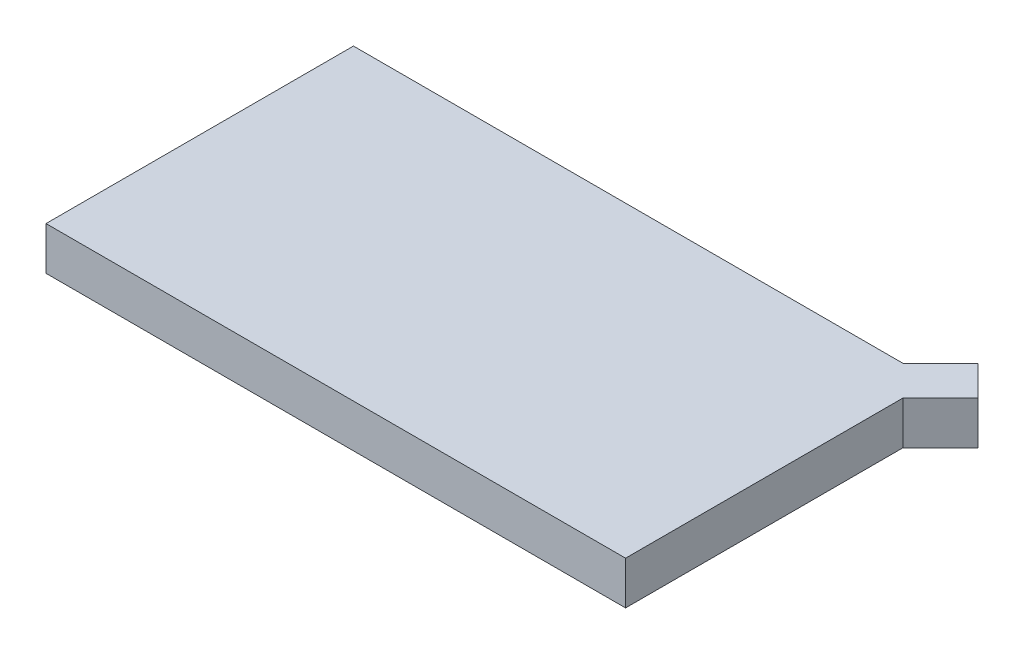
from build123d import *

# Parameters (mm, degrees)
SCHIZZO1_W                    = 140
SCHIZZO1_H                    = 70
ESTRUSIONE_ESTRUSIONE1_DEPTH  = 7.2
ESTRUSIONE_ESTRUSIONE14_DEPTH = 0.38
SCALA1_SCALE_X                = 1.1
SCALA1_SCALE_Y                = 1
SCALA1_SCALE_Z                = 1.1
SCHIZZO20_W                   = 164
SCHIZZO20_H                   = 87
ESTRUSIONE_ESTRUSIONE15_DEPTH = 3
SCHIZZO21_W                   = 164
SCHIZZO21_H                   = 87
SCHIZZO21_W_2                 = 158
SCHIZZO21_H_2                 = 81
ESTRUSIONE_SOTTILE1_DEPTH     = 9.2
ESTRUSIONE_ESTRUSIONE16_DEPTH = 12.2
TAGLIO_ESTRUSIONE1_DEPTH      = 2
ESTRUSIONE_ESTRUSIONE17_REACH = 180.336


with BuildPart() as part:
    # Schizzo1 → Estrusione-Estrusione1 (new body)
    with BuildSketch(Plane(origin=(0, 0, 0), x_dir=(1, 0, 0), z_dir=(0, 1, 0))):
        with Locations((70, 35)):
            Rectangle(SCHIZZO1_W, SCHIZZO1_H)
    extrude(amount=ESTRUSIONE_ESTRUSIONE1_DEPTH)

    # Schizzo18 → Estrusione-Estrusione14 (add)
    # profile 1 of 6: a face of its own
    with BuildSketch(Plane.XZ):
        with BuildLine():
            add(Edge.make_bspline(
                [(4.411042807, -67.107892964), (4.846458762, -57.462710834), (4.490422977, -44.932056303), (4.838064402, -30.017690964), (5.98839202, -23.419872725), (7.991307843, -15.96780223), (11.464408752, -8.374032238), (16.895277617, -4.19430479), (19.441568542, -3.323486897)],
                knots=[0, 0, 0, 0, 0.419898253, 0.546803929, 0.648911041, 0.710435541, 0.883826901, 1, 1, 1, 1], degree=3))
            add(Edge.make_bspline(
                [(19.441568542, -3.323486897), (19.882918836, -3.203174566), (20.132212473, -3.155155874), (22.530633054, -3.1245091), (24.305344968, -3.146759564), (25.076938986, -4.278983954), (25.667653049, -4.896360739)],
                knots=[0, 0, 0, 0, 0.19175978, 0.475090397, 0.535927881, 1, 1, 1, 1], degree=3))
            add(Edge.make_bspline(
                [(25.667653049, -4.896360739), (26.1575005, -5.687869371), (27.245382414, -6.797940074), (28.765569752, -9.51547356), (28.734353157, -11.756648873), (29.077142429, -13.213694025)],
                knots=[0, 0, 0, 0, 0.302142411, 0.505950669, 1, 1, 1, 1], degree=3))
            add(Edge.make_bspline(
                [(29.077142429, -13.213694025), (28.93697153, -21.364030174), (29.710569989, -29.550660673), (28.930231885, -37.690001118)],
                knots=[0, 0, 0, 0, 1, 1, 1, 1], degree=3))
            add(Edge.make_bspline(
                [(28.930231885, -37.690001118), (29.141755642, -37.712508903), (29.967850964, -37.677342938), (29.919783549, -38.414813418), (29.494169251, -38.891834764), (28.962952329, -38.577493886), (28.679174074, -38.66878937)],
                knots=[0, 0, 0, 0, 0.357743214, 0.535351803, 0.655195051, 1, 1, 1, 1], degree=3))
            add(Edge.make_bspline(
                [(28.679174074, -38.66878937), (28.721975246, -40.341383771), (28.194046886, -43.448474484), (27.659803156, -49.329128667), (27.470074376, -55.179228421), (26.904768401, -61.888179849), (26.262850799, -65.828389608), (26.387404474, -68.198591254)],
                knots=[0, 0, 0, 0, 0.168521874, 0.31832189, 0.597595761, 0.760729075, 1, 1, 1, 1], degree=3))
            Line((26.387404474, -68.198591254), (25.234819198, -68.139620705))
            add(Edge.make_bspline(
                [(25.234819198, -68.139620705), (25.174538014, -65.800618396), (25.475521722, -61.368840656), (25.560245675, -55.221546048), (26.321631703, -47.736799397), (26.647790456, -42.322429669), (27.343147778, -38.66878937)],
                knots=[0, 0, 0, 0, 0.23696922, 0.450581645, 0.623179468, 1, 1, 1, 1], degree=3))
            Line((27.343147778, -38.66878937), (5.798154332, -39.488525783))
            Line((5.798154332, -39.488525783), (5.451349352, -67.107892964))
            Line((5.451349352, -67.107892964), (4.411042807, -67.107892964))
        make_face()
        with BuildLine():
            Line((5.798154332, -38.196019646), (27.805550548, -37.690001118))
            Line((27.805550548, -37.690001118), (28.048038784, -16.982014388))
            add(Edge.make_bspline(
                [(21.74668991, -4.470475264), (22.416749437, -4.49775911), (23.834246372, -4.436995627), (24.821419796, -5.608516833), (26.134670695, -6.955688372), (27.868459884, -10.704641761), (27.992640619, -14.279789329), (28.048038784, -16.982014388)],
                knots=[0, 0, 0, 0, 0.127848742, 0.206480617, 0.348264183, 0.466198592, 1, 1, 1, 1], degree=3))
            add(Edge.make_bspline(
                [(5.798154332, -38.196019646), (6.076613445, -33.923662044), (6.213493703, -26.626614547), (8.754348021, -17.751864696), (11.533039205, -11.302253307), (14.953417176, -7.578939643), (18.897609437, -4.574136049), (20.088358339, -4.497025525), (21.74668991, -4.470475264)],
                knots=[0, 0, 0, 0, 0.319107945, 0.532392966, 0.683615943, 0.827156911, 0.920779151, 1, 1, 1, 1], degree=3))
        make_face(mode=Mode.SUBTRACT)
    # profile 2 of 6: a face of its own
    with BuildSketch(Plane.XZ):
        with BuildLine():
            add(Edge.make_bspline(
                [(34.950062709, -65.668904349), (34.871374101, -66.296432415), (36.243981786, -66.447866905), (36.26149238, -65.177492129), (36.439196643, -64.827355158)],
                knots=[0, 0, 0, 0, 0.459177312, 1, 1, 1, 1], degree=3))
            add(Edge.make_bspline(
                [(36.439196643, -64.827355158), (36.700289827, -62.189818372), (37.447354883, -56.073014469), (38.361189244, -46.673198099), (38.723722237, -37.500500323), (39.254272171, -28.863149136), (40.386111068, -19.495178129), (39.922387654, -12.447198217), (40.098909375, -8.41279914)],
                knots=[0, 0, 0, 0, 0.1405419, 0.326834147, 0.500614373, 0.627255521, 0.785807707, 1, 1, 1, 1], degree=3))
            add(Edge.make_bspline(
                [(40.098909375, -8.41279914), (40.706737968, -9.755063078), (42.287962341, -11.68548892), (44.186020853, -13.640785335), (45.325960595, -13.825563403)],
                knots=[0, 0, 0, 0, 0.560834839, 1, 1, 1, 1], degree=3))
            add(Edge.make_bspline(
                [(45.325960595, -13.825563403), (46.291141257, -13.846175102), (46.72134483, -12.310049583), (48.012819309, -10.884018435), (49.060982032, -8.557885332), (50.664421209, -7.354902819), (51.503077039, -6.307794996)],
                knots=[0, 0, 0, 0, 0.240084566, 0.419220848, 0.589027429, 1, 1, 1, 1], degree=3))
            add(Edge.make_bspline(
                [(51.503077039, -6.307794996), (51.5856987, -10.985130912), (51.943875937, -17.465494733), (50.973465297, -26.528286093), (50.163412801, -41.429065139), (49.031667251, -54.529097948), (49.430040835, -65.051585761)],
                knots=[0, 0, 0, 0, 0.238747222, 0.329563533, 0.464532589, 1, 1, 1, 1], degree=3))
            add(Edge.make_bspline(
                [(49.430040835, -65.051585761), (49.613473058, -65.240180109), (49.511886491, -66.187865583), (50.645431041, -66.153520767), (50.704795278, -65.143522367), (50.572630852, -64.827355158)],
                knots=[0, 0, 0, 0, 0.402054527, 0.50799026, 1, 1, 1, 1], degree=3))
            add(Edge.make_bspline(
                [(50.572630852, -64.827355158), (51.544201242, -57.004937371), (50.612356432, -46.556541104), (51.594181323, -33.218361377), (52.017812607, -26.597009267), (53.068737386, -21.114351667), (52.758191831, -15.930356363), (52.842231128, -10.421128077), (52.939189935, -6.351575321), (52.617588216, -4.896360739)],
                knots=[0, 0, 0, 0, 0.392039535, 0.520684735, 0.667928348, 0.723337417, 0.798507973, 0.925696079, 1, 1, 1, 1], degree=3))
            add(Edge.make_bspline(
                [(52.617588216, -4.896360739), (52.515627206, -4.882142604), (52.240632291, -4.069562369), (51.59313581, -4.48934429), (51.329516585, -4.664457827), (51.103138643, -4.896360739)],
                knots=[0, 0, 0, 0, 0.433178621, 0.568370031, 1, 1, 1, 1], degree=3))
            add(Edge.make_bspline(
                [(51.103138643, -4.896360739), (49.861354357, -5.962668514), (48.63642612, -7.79735917), (46.884030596, -9.920692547), (46.267514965, -11.360049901), (45.514555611, -12.113561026), (44.722615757, -12.751567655), (44.104261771, -11.85060463), (43.378664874, -11.090985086), (42.548010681, -9.904448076), (41.575480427, -8.709583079), (40.902578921, -7.548024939), (40.455106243, -6.681581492), (40.079946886, -5.974767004), (40.486449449, -5.222101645), (39.90789502, -4.971907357), (39.49391315, -5.180152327), (39.281140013, -5.701265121), (38.81028981, -6.495271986), (38.961245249, -7.602766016), (38.990366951, -9.88312924), (38.733805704, -11.728691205), (38.800158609, -13.213694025)],
                knots=[0, 0, 0, 0, 0.175068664, 0.236886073, 0.297798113, 0.338205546, 0.35790543, 0.391834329, 0.426770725, 0.481522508, 0.543644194, 0.594549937, 0.625339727, 0.650120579, 0.678127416, 0.693256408, 0.702950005, 0.725632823, 0.75112271, 0.801752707, 0.839319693, 1, 1, 1, 1], degree=3))
            add(Edge.make_bspline(
                [(38.800158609, -13.213694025), (38.778246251, -15.337262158), (39.206993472, -18.660892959), (38.789789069, -23.359609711), (38.4575495, -26.694723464), (37.988555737, -30.4592836), (37.89257985, -34.194375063), (37.169946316, -38.397972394), (37.414055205, -42.845212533), (36.937485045, -49.156184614), (36.246415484, -55.62336645), (35.488181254, -61.580415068), (35.34201129, -64.386703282), (34.950062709, -65.668904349)],
                knots=[0, 0, 0, 0, 0.121018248, 0.189326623, 0.268021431, 0.31203999, 0.405268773, 0.480496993, 0.553838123, 0.657857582, 0.840594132, 0.924218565, 1, 1, 1, 1], degree=3))
        make_face()
    # profile 3 of 6: a face of its own
    with BuildSketch(Plane.XZ):
        with BuildLine():
            add(Edge.make_bspline(
                [(57.898590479, -66.587687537), (57.758273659, -66.654030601), (57.835874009, -67.858778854), (59.013866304, -67.221062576), (58.811839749, -66.391886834), (59.08635954, -65.928005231)],
                knots=[0, 0, 0, 0, 0.34739359, 0.48728406, 1, 1, 1, 1], degree=3))
            add(Edge.make_bspline(
                [(59.08635954, -65.928005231), (59.154459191, -63.892682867), (59.011733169, -57.727177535), (59.097015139, -51.56083139), (59.08635954, -47.430300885)],
                knots=[0, 0, 0, 0, 0.330109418, 1, 1, 1, 1], degree=3))
            add(Edge.make_bspline(
                [(59.08635954, -47.430300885), (59.087277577, -44.595647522), (58.799676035, -39.63079843), (59.162657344, -33.777554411), (58.999063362, -29.675920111), (59.48970272, -26.569170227), (59.692253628, -23.106737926), (60.464274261, -20.11453794), (61.016408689, -16.845955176), (62.149143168, -13.795080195), (63.878730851, -9.938737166), (65.572294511, -6.893509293), (68.022135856, -5.584552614), (69.601113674, -5.817682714), (71.233275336, -5.573521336), (73.215370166, -6.31473808), (74.44762969, -8.059625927), (75.38966605, -9.890391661), (76.168868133, -11.652019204), (76.221645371, -13.552614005), (76.343229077, -18.114020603), (76.089874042, -28.155365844), (75.536679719, -37.529536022), (75.90336239, -43.638324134)],
                knots=[0, 0, 0, 0, 0.097306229, 0.17033012, 0.201123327, 0.237790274, 0.277939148, 0.319866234, 0.343480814, 0.391636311, 0.430519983, 0.489940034, 0.505722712, 0.52168246, 0.543112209, 0.56181365, 0.590799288, 0.613427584, 0.633228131, 0.655942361, 0.677792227, 0.790290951, 1, 1, 1, 1], degree=3))
            add(Edge.make_bspline(
                [(75.90336239, -43.638324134), (73.701448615, -43.608950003), (70.383944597, -43.628013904), (64.880112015, -43.968361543), (61.638284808, -44.861011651), (59.799177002, -46.149817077)],
                knots=[0, 0, 0, 0, 0.399622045, 0.601949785, 1, 1, 1, 1], degree=3))
            add(Edge.make_bspline(
                [(59.799177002, -46.149817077), (59.455246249, -46.188066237), (59.20474885, -46.779862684), (59.825458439, -47.2728515), (60.577094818, -46.774733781), (61.265359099, -46.069183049), (62.75336732, -45.895137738), (64.422631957, -45.493450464), (68.834309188, -44.714803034), (72.689244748, -44.914741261), (75.749473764, -44.666602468)],
                knots=[0, 0, 0, 0, 0.050575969, 0.077403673, 0.108507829, 0.185421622, 0.245884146, 0.351801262, 0.479874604, 1, 1, 1, 1], degree=3))
            Line((75.749473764, -44.666602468), (75.715121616, -66.443283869))
            add(Edge.make_bspline(
                [(75.715121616, -66.443283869), (76.03347624, -67.43922913), (77.014913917, -66.342601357), (77.126880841, -65.928005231)],
                knots=[0, 0, 0, 0, 1, 1, 1, 1], degree=3))
            Line((77.126880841, -65.928005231), (76.93800923, -44.666602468))
            add(Edge.make_bspline(
                [(76.93800923, -44.666602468), (77.061000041, -37.853237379), (77.380269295, -31.043858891), (77.395381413, -24.228452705)],
                knots=[0, 0, 0, 0, 1, 1, 1, 1], degree=3))
            add(Edge.make_bspline(
                [(77.395381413, -24.228452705), (77.253547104, -20.171496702), (77.635831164, -16.102826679), (77.144172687, -12.057814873)],
                knots=[0, 0, 0, 0, 1, 1, 1, 1], degree=3))
            add(Edge.make_bspline(
                [(77.144172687, -12.057814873), (76.721583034, -10.789582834), (76.286713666, -8.699352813), (73.975370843, -5.932284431), (72.113052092, -4.559489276), (70.482031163, -4.55503261)],
                knots=[0, 0, 0, 0, 0.380123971, 0.570312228, 1, 1, 1, 1], degree=3))
            Line((70.482031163, -4.55503261), (68.039524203, -4.611397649))
            add(Edge.make_bspline(
                [(68.039524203, -4.611397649), (67.017641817, -4.933973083), (65.496158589, -6.044091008), (63.202069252, -8.790745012), (59.281535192, -15.350711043), (58.300420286, -22.325835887), (57.898590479, -27.298828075)],
                knots=[0, 0, 0, 0, 0.122499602, 0.21378125, 0.413644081, 1, 1, 1, 1], degree=3))
            add(Edge.make_bspline(
                [(57.898590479, -27.298828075), (57.388966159, -32.285403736), (57.530166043, -41.121950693), (58.018720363, -54.212243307), (57.857462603, -62.312085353), (57.898590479, -66.587687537)],
                knots=[0, 0, 0, 0, 0.382023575, 0.67357814, 1, 1, 1, 1], degree=3))
        make_face()
    # profile 4 of 6: a face of its own
    with BuildSketch(Plane.XZ):
        with BuildLine():
            add(Edge.make_bspline(
                [(86.395885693, -12.057814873), (86.008995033, -12.377264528), (86.94947202, -13.28359487), (87.270756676, -12.077289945), (87.476622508, -11.18913835), (88.211003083, -9.807345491), (88.992198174, -8.607505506), (90.548046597, -7.456572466), (92.422178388, -6.508616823), (95.533428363, -5.314591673), (98.596306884, -5.307192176), (101.012337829, -5.050983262), (102.279747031, -5.442822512), (102.708921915, -6.556885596), (103.111303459, -7.92246417), (103.332478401, -11.019556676), (103.557476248, -14.163055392), (102.771289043, -17.731658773), (101.355036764, -21.053744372), (97.803584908, -25.524298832), (93.451865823, -29.147813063), (89.949725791, -31.884886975), (88.355176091, -33.351686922), (88.182755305, -34.549660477), (88.649692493, -35.041009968), (89.380907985, -35.271193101), (90.072196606, -35.875691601), (91.248040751, -36.477091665), (92.202863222, -37.653762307), (93.702341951, -39.141559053), (94.714219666, -41.34357545), (96.648113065, -43.77207124), (97.520878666, -46.56171728), (98.978928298, -49.726852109), (101.101706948, -55.157278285), (103.187923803, -59.77738621), (104.400535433, -63.094105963)],
                knots=[0, 0, 0, 0, 0.012808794, 0.019115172, 0.033144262, 0.047539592, 0.070675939, 0.081383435, 0.112793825, 0.141978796, 0.193750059, 0.214839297, 0.225498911, 0.23507559, 0.253027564, 0.2747187, 0.33982098, 0.359076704, 0.398442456, 0.461396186, 0.551235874, 0.589018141, 0.615097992, 0.620831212, 0.627504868, 0.635805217, 0.646817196, 0.658133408, 0.680354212, 0.697317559, 0.729754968, 0.761409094, 0.80197949, 0.827722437, 0.880013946, 1, 1, 1, 1], degree=3))
            add(Edge.make_bspline(
                [(104.400535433, -63.094105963), (105.28257143, -63.93925825), (105.844312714, -62.219809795), (105.341728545, -61.725465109)],
                knots=[0, 0, 0, 0, 1, 1, 1, 1], degree=3))
            add(Edge.make_bspline(
                [(105.341728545, -61.725465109), (104.711199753, -59.704611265), (103.034130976, -56.755169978), (101.714332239, -52.625876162), (99.667561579, -48.417717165), (99.121809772, -44.983128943), (97.736981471, -42.889488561)],
                knots=[0, 0, 0, 0, 0.311231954, 0.497086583, 0.638195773, 1, 1, 1, 1], degree=3))
            add(Edge.make_bspline(
                [(97.736981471, -42.889488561), (97.005758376, -41.255273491), (95.487104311, -39.100672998), (92.74385727, -36.146952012), (90.77796629, -35.023533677), (89.680256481, -34.193855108)],
                knots=[0, 0, 0, 0, 0.443490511, 0.655298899, 1, 1, 1, 1], degree=3))
            add(Edge.make_bspline(
                [(89.680256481, -34.193855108), (91.633790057, -32.252000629), (94.691581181, -29.463276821), (98.657399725, -25.634793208), (101.685218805, -22.814047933), (103.195382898, -19.164668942), (104.307865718, -16.721566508), (104.291807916, -15.481911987)],
                knots=[0, 0, 0, 0, 0.341341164, 0.51026411, 0.686049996, 0.842635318, 1, 1, 1, 1], degree=3))
            add(Edge.make_bspline(
                [(104.291807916, -15.481911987), (104.246023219, -11.947355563), (104.200238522, -8.41279914)],
                knots=[0, 0, 0, 1, 1, 1], degree=2))
            add(Edge.make_bspline(
                [(104.200238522, -8.41279914), (103.874565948, -7.538446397), (103.964592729, -5.581417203), (102.404111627, -4.23254863), (101.526334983, -4.110000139)],
                knots=[0, 0, 0, 0, 0.520593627, 1, 1, 1, 1], degree=3))
            Line((101.526334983, -4.110000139), (95.676421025, -4.20566449))
            add(Edge.make_bspline(
                [(95.676421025, -4.20566449), (94.577467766, -4.388904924), (92.639553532, -5.047574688), (90.060566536, -6.40893426), (87.567436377, -8.487700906), (86.526526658, -10.632593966), (86.395885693, -12.057814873)],
                knots=[0, 0, 0, 0, 0.257109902, 0.471754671, 0.672719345, 1, 1, 1, 1], degree=3))
        make_face()
    # profile 5 of 6: a face of its own
    with BuildSketch(Plane.XZ):
        with BuildLine():
            add(Edge.make_bspline(
                [(84.518040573, -7.383627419), (84.764440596, -14.743966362), (84.978542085, -27.182654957), (85.905630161, -43.358348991), (86.896148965, -55.999516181), (87.660307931, -63.58385247), (87.532029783, -67.439842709)],
                knots=[0, 0, 0, 0, 0.367329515, 0.620430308, 0.807889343, 1, 1, 1, 1], degree=3))
            add(Edge.make_bspline(
                [(87.532029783, -67.439842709), (87.513920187, -67.920303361), (88.523003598, -68.319960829), (89.033348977, -67.240253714), (88.929822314, -66.572254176), (88.629636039, -66.135723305)],
                knots=[0, 0, 0, 0, 0.412793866, 0.538365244, 1, 1, 1, 1], degree=3))
            add(Edge.make_bspline(
                [(88.629636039, -66.135723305), (88.827619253, -61.930554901), (88.28258172, -54.867844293), (87.900572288, -46.58752882), (87.512509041, -40.859229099), (86.985904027, -34.878124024), (87.223228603, -28.589045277), (86.017142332, -19.259018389), (86.059316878, -12.98992163), (85.674527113, -8.230742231)],
                knots=[0, 0, 0, 0, 0.217009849, 0.366309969, 0.428752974, 0.514007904, 0.67676425, 0.752933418, 1, 1, 1, 1], degree=3))
            add(Edge.make_bspline(
                [(84.518040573, -7.383627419), (85.006673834, -6.550138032), (85.657843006, -7.826407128), (85.674527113, -8.230742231)],
                knots=[0, 0, 0, 0, 1, 1, 1, 1], degree=3))
        make_face()
    # profile 6 of 6: a face of its own
    with BuildSketch(Plane.XZ):
        with BuildLine():
            add(Edge.make_bspline(
                [(115.472287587, -66.135723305), (114.549875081, -60.660185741), (112.097375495, -51.121245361), (111.551944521, -37.487252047), (111.507427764, -27.447930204), (111.886367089, -19.013911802), (114.430925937, -11.986751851), (120.578183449, -4.36389372), (129.06111214, -4.792906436), (131.174310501, -8.5949333)],
                knots=[0, 0, 0, 0, 0.223410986, 0.39352585, 0.546164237, 0.62795949, 0.730566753, 0.843233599, 1, 1, 1, 1], degree=3))
            add(Edge.make_bspline(
                [(131.174310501, -8.5949333), (131.713546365, -11.162753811), (133.901303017, -15.523085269), (134.854977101, -22.323580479), (134.97853722, -28.85819801), (134.540625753, -33.183606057), (134.608464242, -35.532567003)],
                knots=[0, 0, 0, 0, 0.285596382, 0.526081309, 0.743277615, 1, 1, 1, 1], degree=3))
            add(Edge.make_bspline(
                [(134.608464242, -35.532567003), (135.048535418, -35.280505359), (135.563680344, -35.864302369), (135.467849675, -36.547597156), (135.246988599, -37.09802509), (134.780521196, -37.025423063), (134.608464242, -37.169740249)],
                knots=[0, 0, 0, 0, 0.417489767, 0.619709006, 0.75283337, 1, 1, 1, 1], degree=3))
            Line((134.608464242, -37.169740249), (134.487804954, -62.60401259))
            add(Edge.make_bspline(
                [(134.487804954, -62.60401259), (134.532200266, -63.138210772), (133.639623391, -63.41456759), (132.798594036, -63.115534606), (132.804436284, -62.60401259)],
                knots=[0, 0, 0, 0, 0.505444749, 1, 1, 1, 1], degree=3))
            add(Edge.make_bspline(
                [(132.804436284, -62.60401259), (132.461214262, -49.890552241), (132.677232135, -37.169740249)],
                knots=[0, 0, 0, 1, 1, 1], degree=2))
            add(Edge.make_bspline(
                [(132.677232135, -37.169740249), (130.266450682, -37.55261722), (126.638521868, -38.938035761), (120.163160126, -39.370145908), (116.512248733, -41.248635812), (113.94131632, -41.64745497)],
                knots=[0, 0, 0, 0, 0.379027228, 0.596976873, 1, 1, 1, 1], degree=3))
            add(Edge.make_bspline(
                [(113.94131632, -41.64745497), (114.002357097, -43.697032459), (114.280824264, -47.300182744), (115.356357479, -52.123526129), (115.46642406, -58.304974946), (116.05261245, -62.88214687), (116.565360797, -66.135723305)],
                knots=[0, 0, 0, 0, 0.249652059, 0.43879371, 0.599153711, 1, 1, 1, 1], degree=3))
            add(Edge.make_bspline(
                [(116.565360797, -66.135723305), (116.579625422, -66.435769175), (117.317694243, -68.000256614), (116.307130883, -67.601549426)],
                knots=[0, 0, 0, 0, 1, 1, 1, 1], degree=3))
            Line((116.307130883, -67.601549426), (115.472287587, -66.135723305))
        make_face()
        with BuildLine():
            add(Edge.make_bspline(
                [(113.94131632, -40.352385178), (115.669708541, -39.453603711), (119.341090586, -38.367733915), (125.654095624, -37.134215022), (129.979901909, -35.608592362), (132.677232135, -36.057417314)],
                knots=[0, 0, 0, 0, 0.300897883, 0.590055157, 1, 1, 1, 1], degree=3))
            add(Edge.make_bspline(
                [(127.631171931, -7.108145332), (129.155971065, -8.184333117), (130.532981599, -11.24088072), (131.686462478, -15.861195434), (132.542462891, -20.454549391), (132.213858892, -27.250874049), (132.369402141, -32.479309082), (132.677232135, -36.057417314)],
                knots=[0, 0, 0, 0, 0.179503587, 0.323922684, 0.477332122, 0.642490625, 1, 1, 1, 1], degree=3))
            add(Edge.make_bspline(
                [(113.94131632, -40.352385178), (113.378965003, -36.949336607), (113.138737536, -31.745617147), (113.102417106, -25.794668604), (113.238266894, -22.131907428), (113.89533723, -18.973883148), (115.405986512, -14.882473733), (117.37721116, -10.790952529), (121.876322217, -7.652642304), (125.139796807, -6.236597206), (127.631171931, -7.108145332)],
                knots=[0, 0, 0, 0, 0.249253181, 0.376503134, 0.430937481, 0.514361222, 0.608142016, 0.748608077, 0.83083604, 1, 1, 1, 1], degree=3))
        make_face(mode=Mode.SUBTRACT)
    extrude(amount=ESTRUSIONE_ESTRUSIONE14_DEPTH)


with BuildPart() as part_1:
    # Scala1: scaled about (70.019204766, 3.579452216, -34.996159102)
    add(part.part.scale((SCALA1_SCALE_X, SCALA1_SCALE_Y, SCALA1_SCALE_Z), about=(70.019204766, 3.579452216, -34.996159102)))

    # Schizzo20 → Estrusione-Estrusione15 (add)
    with BuildSketch(Plane(origin=(0, 7.2, 0), x_dir=(1, 0, 0), z_dir=(0, 1, 0))):
        with Locations((69.998093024, 35.000375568)):
            Rectangle(SCHIZZO20_W, SCHIZZO20_H)
    extrude(amount=ESTRUSIONE_ESTRUSIONE15_DEPTH)

    # Schizzo21 → Estrusione-Sottile1 (add)
    with BuildSketch(Plane.XZ.offset(-7.2)):
        with Locations((69.998093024, -35.000375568)):
            Rectangle(SCHIZZO21_W, SCHIZZO21_H)
        with Locations((69.998093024, -35.000375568)):
            Rectangle(SCHIZZO21_W_2, SCHIZZO21_H_2, mode=Mode.SUBTRACT)
    extrude(amount=ESTRUSIONE_SOTTILE1_DEPTH)

    # Schizzo22 → Estrusione-Estrusione16 (add)
    with BuildSketch(Plane(origin=(0, 10.2, 0), x_dir=(1, 0, 0), z_dir=(0, 1, 0))):
        Polygon((143.51281165, 78.500375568), (154.119413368, 89.106977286), (162.604694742, 80.621695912), (151.998093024, 70.015094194), (151.998093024, 78.500375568), align=None)
    extrude(amount=-ESTRUSIONE_ESTRUSIONE16_DEPTH)

    # Schizzo23 → Taglio-Estrusione1 (cut)
    with BuildSketch(Plane.XZ.offset(2)):
        Polygon((142.634131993, -75.500375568), (154.119413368, -86.985656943), (160.483374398, -80.621695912), (148.998093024, -69.136414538), (148.998093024, -75.500375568), align=None)
    extrude(amount=-TAGLIO_ESTRUSIONE1_DEPTH, mode=Mode.SUBTRACT)

    # Schizzo24 → Estrusione-Estrusione17 (add, up to next)
    with BuildSketch(Plane(origin=(39.930839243, 0, 39.930839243), x_dir=(-0.7071067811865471, 0, 0.7071067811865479), z_dir=(-0.7071067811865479, 0, -0.7071067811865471)), mode=Mode.PRIVATE) as estrusione_estrusione17_sk1:
        Polygon((-170.487030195, -2), (-167.02292858, 0), (-170.487030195, 0), align=None)
    estrusione_estrusione17_tool1 = extrude(estrusione_estrusione17_sk1.sketch, amount=ESTRUSIONE_ESTRUSIONE17_REACH, mode=Mode.PRIVATE) - part_1.part
    add(estrusione_estrusione17_tool1.solids().sort_by_distance((159.666878, -0.666667, -79.805199))[0])


solid = part_1.part
